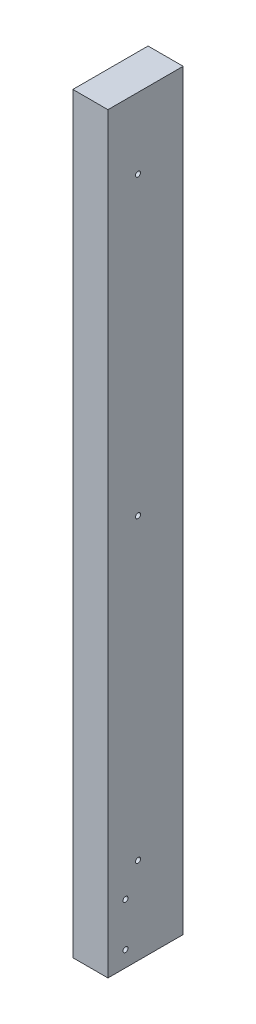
ISO-10303-21;
HEADER;
FILE_DESCRIPTION(('STEP AP214'),'2;1');
FILE_NAME('part.step','',(''),(''),'','','');
FILE_SCHEMA(('AUTOMOTIVE_DESIGN { 1 0 10303 214 1 1 1 1 }'));
ENDSEC;
DATA;
#1=APPLICATION_CONTEXT('core data for automotive mechanical design processes');
#2=APPLICATION_PROTOCOL_DEFINITION('international standard','automotive_design',2000,#1);
#3=PRODUCT_CONTEXT('',#1,'mechanical');
#4=PRODUCT('Part','Part','',(#3));
#5=PRODUCT_RELATED_PRODUCT_CATEGORY('part','',(#4));
#6=PRODUCT_DEFINITION_FORMATION('','',#4);
#7=PRODUCT_DEFINITION_CONTEXT('part definition',#1,'design');
#8=PRODUCT_DEFINITION('design','',#6,#7);
#9=PRODUCT_DEFINITION_SHAPE('','',#8);
#10=(LENGTH_UNIT() NAMED_UNIT(*) SI_UNIT(.MILLI.,.METRE.));
#11=(NAMED_UNIT(*) PLANE_ANGLE_UNIT() SI_UNIT($,.RADIAN.));
#12=(NAMED_UNIT(*) SI_UNIT($,.STERADIAN.) SOLID_ANGLE_UNIT());
#13=UNCERTAINTY_MEASURE_WITH_UNIT(LENGTH_MEASURE(1.E-05),#10,'distance_accuracy_value','');
#14=(GEOMETRIC_REPRESENTATION_CONTEXT(3) GLOBAL_UNCERTAINTY_ASSIGNED_CONTEXT((#13)) GLOBAL_UNIT_ASSIGNED_CONTEXT((#10,
#11,#12)) REPRESENTATION_CONTEXT('',''));
#15=CARTESIAN_POINT('',(0.,0.,0.));
#16=DIRECTION('',(0.,0.,1.));
#17=DIRECTION('',(1.,0.,0.));
#18=AXIS2_PLACEMENT_3D('',#15,#16,#17);
#19=CARTESIAN_POINT('',(-9.398,316.866822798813,4.52462285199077));
#20=DIRECTION('',(1.,0.,0.));
#21=DIRECTION('',(0.,0.,-1.));
#22=AXIS2_PLACEMENT_3D('',#19,#20,#21);
#23=PLANE('',#22);
#24=CARTESIAN_POINT('',(-9.398,316.866822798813,4.52462285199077));
#25=DIRECTION('',(1.,0.,0.));
#26=DIRECTION('',(0.,0.,-1.));
#27=AXIS2_PLACEMENT_3D('',#24,#25,#26);
#28=CIRCLE('',#27,1.27000000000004);
#29=CARTESIAN_POINT('',(-9.398,316.866822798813,3.25462285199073));
#30=VERTEX_POINT('',#29);
#31=EDGE_CURVE('E18',#30,#30,#28,.T.);
#32=ORIENTED_EDGE('',*,*,#31,.T.);
#33=EDGE_LOOP('',(#32));
#34=FACE_BOUND('',#33,.T.);
#35=ADVANCED_FACE('F15',(#34),#23,.T.);
#36=CARTESIAN_POINT('',(-9.398,166.975093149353,4.52462285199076));
#37=DIRECTION('',(1.,0.,0.));
#38=DIRECTION('',(0.,0.,-1.));
#39=AXIS2_PLACEMENT_3D('',#36,#37,#38);
#40=PLANE('',#39);
#41=CARTESIAN_POINT('',(-9.398,166.975093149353,4.52462285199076));
#42=DIRECTION('',(1.,0.,0.));
#43=DIRECTION('',(0.,0.,-1.));
#44=AXIS2_PLACEMENT_3D('',#41,#42,#43);
#45=CIRCLE('',#44,1.27000000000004);
#46=CARTESIAN_POINT('',(-9.398,166.975093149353,3.25462285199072));
#47=VERTEX_POINT('',#46);
#48=EDGE_CURVE('E105',#47,#47,#45,.T.);
#49=ORIENTED_EDGE('',*,*,#48,.T.);
#50=EDGE_LOOP('',(#49));
#51=FACE_BOUND('',#50,.T.);
#52=ADVANCED_FACE('F127',(#51),#40,.T.);
#53=CARTESIAN_POINT('',(-9.398,15.7611857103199,4.52462285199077));
#54=DIRECTION('',(1.,0.,0.));
#55=DIRECTION('',(0.,0.,-1.));
#56=AXIS2_PLACEMENT_3D('',#53,#54,#55);
#57=PLANE('',#56);
#58=CARTESIAN_POINT('',(-9.398,15.7611857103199,4.52462285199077));
#59=DIRECTION('',(1.,0.,0.));
#60=DIRECTION('',(0.,0.,-1.));
#61=AXIS2_PLACEMENT_3D('',#58,#59,#60);
#62=CIRCLE('',#61,1.27000000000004);
#63=CARTESIAN_POINT('',(-9.398,15.7611857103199,3.25462285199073));
#64=VERTEX_POINT('',#63);
#65=EDGE_CURVE('E103',#64,#64,#62,.T.);
#66=ORIENTED_EDGE('',*,*,#65,.T.);
#67=EDGE_LOOP('',(#66));
#68=FACE_BOUND('',#67,.T.);
#69=ADVANCED_FACE('F116',(#68),#57,.T.);
#70=CARTESIAN_POINT('',(-9.398,316.866822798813,4.52462285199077));
#71=DIRECTION('',(1.,0.,0.));
#72=DIRECTION('',(0.,0.,-1.));
#73=AXIS2_PLACEMENT_3D('',#70,#71,#72);
#74=CYLINDRICAL_SURFACE('',#73,1.27000000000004);
#75=CARTESIAN_POINT('',(0.,316.866822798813,4.52462285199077));
#76=DIRECTION('',(1.,0.,0.));
#77=DIRECTION('',(0.,0.,-1.));
#78=AXIS2_PLACEMENT_3D('',#75,#76,#77);
#79=CIRCLE('',#78,1.27000000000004);
#80=CARTESIAN_POINT('',(0.,316.866822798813,3.25462285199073));
#81=VERTEX_POINT('',#80);
#82=EDGE_CURVE('E100',#81,#81,#79,.T.);
#83=ORIENTED_EDGE('',*,*,#82,.T.);
#84=EDGE_LOOP('',(#83));
#85=FACE_BOUND('',#84,.T.);
#86=ORIENTED_EDGE('',*,*,#31,.F.);
#87=EDGE_LOOP('',(#86));
#88=FACE_BOUND('',#87,.T.);
#89=ADVANCED_FACE('F113',(#85,#88),#74,.F.);
#90=CARTESIAN_POINT('',(-9.398,166.975093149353,4.52462285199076));
#91=DIRECTION('',(1.,0.,0.));
#92=DIRECTION('',(0.,0.,-1.));
#93=AXIS2_PLACEMENT_3D('',#90,#91,#92);
#94=CYLINDRICAL_SURFACE('',#93,1.27000000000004);
#95=CARTESIAN_POINT('',(0.,166.975093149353,4.52462285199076));
#96=DIRECTION('',(1.,0.,0.));
#97=DIRECTION('',(0.,0.,-1.));
#98=AXIS2_PLACEMENT_3D('',#95,#96,#97);
#99=CIRCLE('',#98,1.27000000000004);
#100=CARTESIAN_POINT('',(0.,166.975093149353,3.25462285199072));
#101=VERTEX_POINT('',#100);
#102=EDGE_CURVE('E97',#101,#101,#99,.T.);
#103=ORIENTED_EDGE('',*,*,#102,.T.);
#104=EDGE_LOOP('',(#103));
#105=FACE_BOUND('',#104,.T.);
#106=ORIENTED_EDGE('',*,*,#48,.F.);
#107=EDGE_LOOP('',(#106));
#108=FACE_BOUND('',#107,.T.);
#109=ADVANCED_FACE('F115',(#105,#108),#94,.F.);
#110=CARTESIAN_POINT('',(-9.398,15.7611857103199,4.52462285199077));
#111=DIRECTION('',(1.,0.,0.));
#112=DIRECTION('',(0.,0.,-1.));
#113=AXIS2_PLACEMENT_3D('',#110,#111,#112);
#114=CYLINDRICAL_SURFACE('',#113,1.27000000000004);
#115=CARTESIAN_POINT('',(0.,15.7611857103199,4.52462285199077));
#116=DIRECTION('',(1.,0.,0.));
#117=DIRECTION('',(0.,0.,-1.));
#118=AXIS2_PLACEMENT_3D('',#115,#116,#117);
#119=CIRCLE('',#118,1.27000000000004);
#120=CARTESIAN_POINT('',(0.,15.7611857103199,3.25462285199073));
#121=VERTEX_POINT('',#120);
#122=EDGE_CURVE('E94',#121,#121,#119,.T.);
#123=ORIENTED_EDGE('',*,*,#122,.T.);
#124=EDGE_LOOP('',(#123));
#125=FACE_BOUND('',#124,.T.);
#126=ORIENTED_EDGE('',*,*,#65,.F.);
#127=EDGE_LOOP('',(#126));
#128=FACE_BOUND('',#127,.T.);
#129=ADVANCED_FACE('F124',(#125,#128),#114,.F.);
#130=CARTESIAN_POINT('',(0.,0.,0.));
#131=DIRECTION('',(-1.,0.,0.));
#132=DIRECTION('',(0.,0.,1.));
#133=AXIS2_PLACEMENT_3D('',#130,#131,#132);
#134=PLANE('',#133);
#135=DIRECTION('',(0.,0.,1.));
#136=VECTOR('',#135,1.);
#137=CARTESIAN_POINT('',(0.,-28.2477880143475,0.));
#138=LINE('',#137,#136);
#139=CARTESIAN_POINT('',(0.,-28.2477880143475,19.7646228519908));
#140=VERTEX_POINT('',#139);
#141=CARTESIAN_POINT('',(0.,-28.2477880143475,-18.3353771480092));
#142=VERTEX_POINT('',#141);
#143=EDGE_CURVE('E88',#140,#142,#138,.F.);
#144=ORIENTED_EDGE('',*,*,#143,.T.);
#145=DIRECTION('',(0.,1.,0.));
#146=VECTOR('',#145,1.);
#147=CARTESIAN_POINT('',(0.,0.,-18.3353771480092));
#148=LINE('',#147,#146);
#149=CARTESIAN_POINT('',(0.,352.752211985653,-18.3353771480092));
#150=VERTEX_POINT('',#149);
#151=EDGE_CURVE('E53',#150,#142,#148,.F.);
#152=ORIENTED_EDGE('',*,*,#151,.F.);
#153=DIRECTION('',(0.,0.,-1.));
#154=VECTOR('',#153,1.);
#155=CARTESIAN_POINT('',(0.,352.752211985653,0.));
#156=LINE('',#155,#154);
#157=CARTESIAN_POINT('',(0.,352.752211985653,19.7646228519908));
#158=VERTEX_POINT('',#157);
#159=EDGE_CURVE('E68',#150,#158,#156,.F.);
#160=ORIENTED_EDGE('',*,*,#159,.T.);
#161=DIRECTION('',(0.,1.,0.));
#162=VECTOR('',#161,1.);
#163=CARTESIAN_POINT('',(0.,0.,19.7646228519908));
#164=LINE('',#163,#162);
#165=EDGE_CURVE('E58',#158,#140,#164,.F.);
#166=ORIENTED_EDGE('',*,*,#165,.T.);
#167=EDGE_LOOP('',(#144,#152,#160,#166));
#168=FACE_BOUND('',#167,.T.);
#169=ORIENTED_EDGE('',*,*,#122,.F.);
#170=EDGE_LOOP('',(#169));
#171=FACE_BOUND('',#170,.T.);
#172=ORIENTED_EDGE('',*,*,#102,.F.);
#173=EDGE_LOOP('',(#172));
#174=FACE_BOUND('',#173,.T.);
#175=ORIENTED_EDGE('',*,*,#82,.F.);
#176=EDGE_LOOP('',(#175));
#177=FACE_BOUND('',#176,.T.);
#178=CARTESIAN_POINT('',(0.,-20.2301901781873,10.8746228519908));
#179=DIRECTION('',(1.,0.,0.));
#180=DIRECTION('',(0.,0.,-1.));
#181=AXIS2_PLACEMENT_3D('',#178,#179,#180);
#182=CIRCLE('',#181,1.27);
#183=CARTESIAN_POINT('',(0.,-20.2301901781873,9.60462285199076));
#184=VERTEX_POINT('',#183);
#185=EDGE_CURVE('E66',#184,#184,#182,.F.);
#186=ORIENTED_EDGE('',*,*,#185,.T.);
#187=EDGE_LOOP('',(#186));
#188=FACE_BOUND('',#187,.T.);
#189=CARTESIAN_POINT('',(0.,1.83461414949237,10.8746228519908));
#190=DIRECTION('',(1.,0.,0.));
#191=DIRECTION('',(0.,0.,-1.));
#192=AXIS2_PLACEMENT_3D('',#189,#190,#191);
#193=CIRCLE('',#192,1.27);
#194=CARTESIAN_POINT('',(0.,1.83461414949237,9.60462285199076));
#195=VERTEX_POINT('',#194);
#196=EDGE_CURVE('E91',#195,#195,#193,.F.);
#197=ORIENTED_EDGE('',*,*,#196,.T.);
#198=EDGE_LOOP('',(#197));
#199=FACE_BOUND('',#198,.T.);
#200=ADVANCED_FACE('F69',(#168,#171,#174,#177,#188,#199),#134,.F.);
#201=CARTESIAN_POINT('',(-24.384,1.83461414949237,10.8746228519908));
#202=DIRECTION('',(1.,0.,0.));
#203=DIRECTION('',(0.,0.,-1.));
#204=AXIS2_PLACEMENT_3D('',#201,#202,#203);
#205=CYLINDRICAL_SURFACE('',#204,1.27);
#206=CARTESIAN_POINT('',(-17.78,1.83461414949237,10.8746228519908));
#207=DIRECTION('',(1.,0.,0.));
#208=DIRECTION('',(0.,0.,-1.));
#209=AXIS2_PLACEMENT_3D('',#206,#207,#208);
#210=CIRCLE('',#209,1.27);
#211=CARTESIAN_POINT('',(-17.78,1.83461414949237,9.60462285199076));
#212=VERTEX_POINT('',#211);
#213=EDGE_CURVE('E85',#212,#212,#210,.T.);
#214=ORIENTED_EDGE('',*,*,#213,.F.);
#215=EDGE_LOOP('',(#214));
#216=FACE_BOUND('',#215,.T.);
#217=ORIENTED_EDGE('',*,*,#196,.F.);
#218=EDGE_LOOP('',(#217));
#219=FACE_BOUND('',#218,.T.);
#220=ADVANCED_FACE('F153',(#216,#219),#205,.F.);
#221=CARTESIAN_POINT('',(-24.384,-20.2301901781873,10.8746228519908));
#222=DIRECTION('',(1.,0.,0.));
#223=DIRECTION('',(0.,0.,-1.));
#224=AXIS2_PLACEMENT_3D('',#221,#222,#223);
#225=CYLINDRICAL_SURFACE('',#224,1.27);
#226=CARTESIAN_POINT('',(-17.78,-20.2301901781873,10.8746228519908));
#227=DIRECTION('',(1.,0.,0.));
#228=DIRECTION('',(0.,0.,-1.));
#229=AXIS2_PLACEMENT_3D('',#226,#227,#228);
#230=CIRCLE('',#229,1.27);
#231=CARTESIAN_POINT('',(-17.78,-20.2301901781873,9.60462285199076));
#232=VERTEX_POINT('',#231);
#233=EDGE_CURVE('E81',#232,#232,#230,.T.);
#234=ORIENTED_EDGE('',*,*,#233,.F.);
#235=EDGE_LOOP('',(#234));
#236=FACE_BOUND('',#235,.T.);
#237=ORIENTED_EDGE('',*,*,#185,.F.);
#238=EDGE_LOOP('',(#237));
#239=FACE_BOUND('',#238,.T.);
#240=ADVANCED_FACE('F150',(#236,#239),#225,.F.);
#241=CARTESIAN_POINT('',(-17.78,0.,19.7646228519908));
#242=DIRECTION('',(0.,0.,-1.));
#243=DIRECTION('',(-1.,0.,0.));
#244=AXIS2_PLACEMENT_3D('',#241,#242,#243);
#245=PLANE('',#244);
#246=DIRECTION('',(1.,0.,0.));
#247=VECTOR('',#246,1.);
#248=CARTESIAN_POINT('',(-17.78,352.752211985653,19.7646228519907));
#249=LINE('',#248,#247);
#250=CARTESIAN_POINT('',(-17.78,352.752211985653,19.7646228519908));
#251=VERTEX_POINT('',#250);
#252=EDGE_CURVE('E61',#158,#251,#249,.F.);
#253=ORIENTED_EDGE('',*,*,#252,.T.);
#254=DIRECTION('',(0.,1.,0.));
#255=VECTOR('',#254,1.);
#256=CARTESIAN_POINT('',(-17.78,0.,19.7646228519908));
#257=LINE('',#256,#255);
#258=CARTESIAN_POINT('',(-17.78,-28.2477880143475,19.7646228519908));
#259=VERTEX_POINT('',#258);
#260=EDGE_CURVE('E84',#259,#251,#257,.T.);
#261=ORIENTED_EDGE('',*,*,#260,.F.);
#262=DIRECTION('',(1.,0.,0.));
#263=VECTOR('',#262,1.);
#264=CARTESIAN_POINT('',(-17.78,-28.2477880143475,19.7646228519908));
#265=LINE('',#264,#263);
#266=EDGE_CURVE('E64',#259,#140,#265,.T.);
#267=ORIENTED_EDGE('',*,*,#266,.T.);
#268=ORIENTED_EDGE('',*,*,#165,.F.);
#269=EDGE_LOOP('',(#253,#261,#267,#268));
#270=FACE_BOUND('',#269,.T.);
#271=ADVANCED_FACE('F59',(#270),#245,.F.);
#272=CARTESIAN_POINT('',(-17.78,352.752211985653,0.));
#273=DIRECTION('',(0.,-1.,0.));
#274=DIRECTION('',(0.,0.,-1.));
#275=AXIS2_PLACEMENT_3D('',#272,#273,#274);
#276=PLANE('',#275);
#277=DIRECTION('',(1.,0.,0.));
#278=VECTOR('',#277,1.);
#279=CARTESIAN_POINT('',(-17.78,352.752211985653,-18.3353771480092));
#280=LINE('',#279,#278);
#281=CARTESIAN_POINT('',(-17.78,352.752211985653,-18.3353771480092));
#282=VERTEX_POINT('',#281);
#283=EDGE_CURVE('E238',#282,#150,#280,.T.);
#284=ORIENTED_EDGE('',*,*,#283,.F.);
#285=DIRECTION('',(0.,0.,1.));
#286=VECTOR('',#285,1.);
#287=CARTESIAN_POINT('',(-17.78,352.752211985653,0.));
#288=LINE('',#287,#286);
#289=EDGE_CURVE('E76',#251,#282,#288,.F.);
#290=ORIENTED_EDGE('',*,*,#289,.F.);
#291=ORIENTED_EDGE('',*,*,#252,.F.);
#292=ORIENTED_EDGE('',*,*,#159,.F.);
#293=EDGE_LOOP('',(#284,#290,#291,#292));
#294=FACE_BOUND('',#293,.T.);
#295=ADVANCED_FACE('F74',(#294),#276,.F.);
#296=CARTESIAN_POINT('',(-17.78,0.,-18.3353771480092));
#297=DIRECTION('',(0.,0.,-1.));
#298=DIRECTION('',(0.,1.,0.));
#299=AXIS2_PLACEMENT_3D('',#296,#297,#298);
#300=PLANE('',#299);
#301=DIRECTION('',(0.,1.,0.));
#302=VECTOR('',#301,1.);
#303=CARTESIAN_POINT('',(-17.78,0.,-18.3353771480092));
#304=LINE('',#303,#302);
#305=CARTESIAN_POINT('',(-17.78,-28.2477880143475,-18.3353771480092));
#306=VERTEX_POINT('',#305);
#307=EDGE_CURVE('E24',#282,#306,#304,.F.);
#308=ORIENTED_EDGE('',*,*,#307,.F.);
#309=ORIENTED_EDGE('',*,*,#283,.T.);
#310=ORIENTED_EDGE('',*,*,#151,.T.);
#311=DIRECTION('',(1.,0.,0.));
#312=VECTOR('',#311,1.);
#313=CARTESIAN_POINT('',(-17.78,-28.2477880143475,-18.3353771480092));
#314=LINE('',#313,#312);
#315=EDGE_CURVE('E33',#142,#306,#314,.F.);
#316=ORIENTED_EDGE('',*,*,#315,.T.);
#317=EDGE_LOOP('',(#308,#309,#310,#316));
#318=FACE_BOUND('',#317,.T.);
#319=ADVANCED_FACE('F138',(#318),#300,.T.);
#320=CARTESIAN_POINT('',(-17.78,-28.2477880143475,0.));
#321=DIRECTION('',(0.,1.,0.));
#322=DIRECTION('',(0.,0.,1.));
#323=AXIS2_PLACEMENT_3D('',#320,#321,#322);
#324=PLANE('',#323);
#325=ORIENTED_EDGE('',*,*,#266,.F.);
#326=DIRECTION('',(0.,0.,1.));
#327=VECTOR('',#326,1.);
#328=CARTESIAN_POINT('',(-17.78,-28.2477880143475,0.));
#329=LINE('',#328,#327);
#330=EDGE_CURVE('E10',#306,#259,#329,.T.);
#331=ORIENTED_EDGE('',*,*,#330,.F.);
#332=ORIENTED_EDGE('',*,*,#315,.F.);
#333=ORIENTED_EDGE('',*,*,#143,.F.);
#334=EDGE_LOOP('',(#325,#331,#332,#333));
#335=FACE_BOUND('',#334,.T.);
#336=ADVANCED_FACE('F132',(#335),#324,.F.);
#337=CARTESIAN_POINT('',(-17.78,0.,0.));
#338=DIRECTION('',(-1.,0.,0.));
#339=DIRECTION('',(0.,0.,1.));
#340=AXIS2_PLACEMENT_3D('',#337,#338,#339);
#341=PLANE('',#340);
#342=ORIENTED_EDGE('',*,*,#307,.T.);
#343=ORIENTED_EDGE('',*,*,#330,.T.);
#344=ORIENTED_EDGE('',*,*,#260,.T.);
#345=ORIENTED_EDGE('',*,*,#289,.T.);
#346=EDGE_LOOP('',(#342,#343,#344,#345));
#347=FACE_BOUND('',#346,.T.);
#348=ORIENTED_EDGE('',*,*,#233,.T.);
#349=EDGE_LOOP('',(#348));
#350=FACE_BOUND('',#349,.T.);
#351=ORIENTED_EDGE('',*,*,#213,.T.);
#352=EDGE_LOOP('',(#351));
#353=FACE_BOUND('',#352,.T.);
#354=ADVANCED_FACE('F130',(#347,#350,#353),#341,.T.);
#355=CLOSED_SHELL('',(#35,#52,#69,#89,#109,#129,#200,#220,#240,#271,#295,#319,#336,#354));
#356=MANIFOLD_SOLID_BREP('B1',#355);
#357=ADVANCED_BREP_SHAPE_REPRESENTATION('',(#18,#356),#14);
#358=SHAPE_DEFINITION_REPRESENTATION(#9,#357);
ENDSEC;
END-ISO-10303-21;
